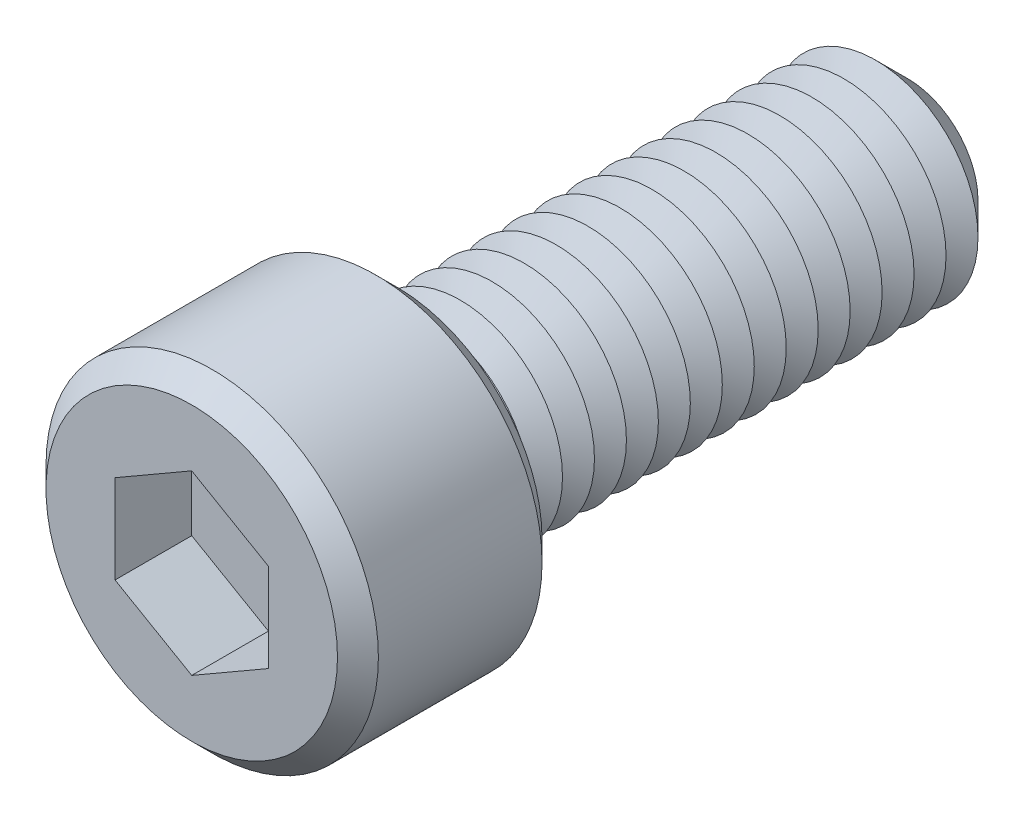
ISO-10303-21;
HEADER;
FILE_DESCRIPTION(('STEP AP214'),'2;1');
FILE_NAME('part.step','',(''),(''),'','','');
FILE_SCHEMA(('AUTOMOTIVE_DESIGN { 1 0 10303 214 1 1 1 1 }'));
ENDSEC;
DATA;
#1=APPLICATION_CONTEXT('core data for automotive mechanical design processes');
#2=APPLICATION_PROTOCOL_DEFINITION('international standard','automotive_design',2000,#1);
#3=PRODUCT_CONTEXT('',#1,'mechanical');
#4=PRODUCT('Part','Part','',(#3));
#5=PRODUCT_RELATED_PRODUCT_CATEGORY('part','',(#4));
#6=PRODUCT_DEFINITION_FORMATION('','',#4);
#7=PRODUCT_DEFINITION_CONTEXT('part definition',#1,'design');
#8=PRODUCT_DEFINITION('design','',#6,#7);
#9=PRODUCT_DEFINITION_SHAPE('','',#8);
#10=(LENGTH_UNIT() NAMED_UNIT(*) SI_UNIT(.MILLI.,.METRE.));
#11=(NAMED_UNIT(*) PLANE_ANGLE_UNIT() SI_UNIT($,.RADIAN.));
#12=(NAMED_UNIT(*) SI_UNIT($,.STERADIAN.) SOLID_ANGLE_UNIT());
#13=UNCERTAINTY_MEASURE_WITH_UNIT(LENGTH_MEASURE(1.E-05),#10,'distance_accuracy_value','');
#14=(GEOMETRIC_REPRESENTATION_CONTEXT(3) GLOBAL_UNCERTAINTY_ASSIGNED_CONTEXT((#13)) GLOBAL_UNIT_ASSIGNED_CONTEXT((#10,
#11,#12)) REPRESENTATION_CONTEXT('',''));
#15=CARTESIAN_POINT('',(0.,0.,0.));
#16=DIRECTION('',(0.,0.,1.));
#17=DIRECTION('',(1.,0.,0.));
#18=AXIS2_PLACEMENT_3D('',#15,#16,#17);
#19=CARTESIAN_POINT('',(0.,0.,8.));
#20=DIRECTION('',(0.,0.,-1.));
#21=DIRECTION('',(-1.,0.,0.));
#22=AXIS2_PLACEMENT_3D('',#19,#20,#21);
#23=CYLINDRICAL_SURFACE('',#22,6.5);
#24=CARTESIAN_POINT('',(0.,0.,0.800000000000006));
#25=DIRECTION('',(0.,0.,1.));
#26=DIRECTION('',(1.,0.,0.));
#27=AXIS2_PLACEMENT_3D('',#24,#25,#26);
#28=CIRCLE('',#27,6.5);
#29=CARTESIAN_POINT('',(6.5,0.,0.800000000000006));
#30=VERTEX_POINT('',#29);
#31=EDGE_CURVE('E297',#30,#30,#28,.T.);
#32=ORIENTED_EDGE('',*,*,#31,.T.);
#33=EDGE_LOOP('',(#32));
#34=FACE_BOUND('',#33,.T.);
#35=CARTESIAN_POINT('',(0.,0.,7.19999999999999));
#36=DIRECTION('',(0.,0.,1.));
#37=DIRECTION('',(1.,0.,0.));
#38=AXIS2_PLACEMENT_3D('',#35,#36,#37);
#39=CIRCLE('',#38,6.5);
#40=CARTESIAN_POINT('',(6.5,0.,7.19999999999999));
#41=VERTEX_POINT('',#40);
#42=EDGE_CURVE('E294',#41,#41,#39,.F.);
#43=ORIENTED_EDGE('',*,*,#42,.T.);
#44=EDGE_LOOP('',(#43));
#45=FACE_BOUND('',#44,.T.);
#46=ADVANCED_FACE('F39',(#34,#45),#23,.T.);
#47=CARTESIAN_POINT('',(0.,0.,8.));
#48=DIRECTION('',(0.,0.,1.));
#49=DIRECTION('',(1.,0.,0.));
#50=AXIS2_PLACEMENT_3D('',#47,#48,#49);
#51=PLANE('',#50);
#52=CARTESIAN_POINT('',(0.,0.,8.));
#53=DIRECTION('',(0.,0.,1.));
#54=DIRECTION('',(1.,0.,0.));
#55=AXIS2_PLACEMENT_3D('',#52,#53,#54);
#56=CIRCLE('',#55,5.7);
#57=CARTESIAN_POINT('',(5.7,0.,8.));
#58=VERTEX_POINT('',#57);
#59=EDGE_CURVE('E11',#58,#58,#56,.T.);
#60=ORIENTED_EDGE('',*,*,#59,.T.);
#61=EDGE_LOOP('',(#60));
#62=FACE_BOUND('',#61,.T.);
#63=DIRECTION('',(-0.866025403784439,0.5,0.));
#64=VECTOR('',#63,1.);
#65=CARTESIAN_POINT('',(3.,1.73205080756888,8.));
#66=LINE('',#65,#64);
#67=CARTESIAN_POINT('',(3.,1.73205080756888,8.));
#68=VERTEX_POINT('',#67);
#69=CARTESIAN_POINT('',(0.,3.46410161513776,8.));
#70=VERTEX_POINT('',#69);
#71=EDGE_CURVE('E55',#68,#70,#66,.T.);
#72=ORIENTED_EDGE('',*,*,#71,.F.);
#73=DIRECTION('',(0.,1.,0.));
#74=VECTOR('',#73,1.);
#75=CARTESIAN_POINT('',(3.,-1.73205080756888,8.));
#76=LINE('',#75,#74);
#77=CARTESIAN_POINT('',(3.,-1.73205080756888,8.));
#78=VERTEX_POINT('',#77);
#79=EDGE_CURVE('E151',#78,#68,#76,.T.);
#80=ORIENTED_EDGE('',*,*,#79,.F.);
#81=DIRECTION('',(0.866025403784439,0.5,0.));
#82=VECTOR('',#81,1.);
#83=CARTESIAN_POINT('',(0.,-3.46410161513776,8.));
#84=LINE('',#83,#82);
#85=CARTESIAN_POINT('',(0.,-3.46410161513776,8.));
#86=VERTEX_POINT('',#85);
#87=EDGE_CURVE('E148',#86,#78,#84,.T.);
#88=ORIENTED_EDGE('',*,*,#87,.F.);
#89=DIRECTION('',(0.866025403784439,-0.5,0.));
#90=VECTOR('',#89,1.);
#91=CARTESIAN_POINT('',(-3.,-1.73205080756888,8.));
#92=LINE('',#91,#90);
#93=CARTESIAN_POINT('',(-3.,-1.73205080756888,8.));
#94=VERTEX_POINT('',#93);
#95=EDGE_CURVE('E103',#94,#86,#92,.T.);
#96=ORIENTED_EDGE('',*,*,#95,.F.);
#97=DIRECTION('',(0.,-1.,0.));
#98=VECTOR('',#97,1.);
#99=CARTESIAN_POINT('',(-3.,1.73205080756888,8.));
#100=LINE('',#99,#98);
#101=CARTESIAN_POINT('',(-3.,1.73205080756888,8.));
#102=VERTEX_POINT('',#101);
#103=EDGE_CURVE('E142',#102,#94,#100,.T.);
#104=ORIENTED_EDGE('',*,*,#103,.F.);
#105=DIRECTION('',(-0.866025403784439,-0.5,0.));
#106=VECTOR('',#105,1.);
#107=CARTESIAN_POINT('',(0.,3.46410161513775,8.));
#108=LINE('',#107,#106);
#109=EDGE_CURVE('E137',#70,#102,#108,.T.);
#110=ORIENTED_EDGE('',*,*,#109,.F.);
#111=EDGE_LOOP('',(#72,#80,#88,#96,#104,#110));
#112=FACE_BOUND('',#111,.T.);
#113=ADVANCED_FACE('F315',(#62,#112),#51,.T.);
#114=CARTESIAN_POINT('',(0.,0.,0.));
#115=DIRECTION('',(0.,0.,1.));
#116=DIRECTION('',(1.,0.,0.));
#117=AXIS2_PLACEMENT_3D('',#114,#115,#116);
#118=PLANE('',#117);
#119=CARTESIAN_POINT('',(0.,0.,0.));
#120=DIRECTION('',(0.,0.,1.));
#121=DIRECTION('',(1.,0.,0.));
#122=AXIS2_PLACEMENT_3D('',#119,#120,#121);
#123=CIRCLE('',#122,5.69999999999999);
#124=CARTESIAN_POINT('',(5.69999999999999,0.,0.));
#125=VERTEX_POINT('',#124);
#126=EDGE_CURVE('E48',#125,#125,#123,.F.);
#127=ORIENTED_EDGE('',*,*,#126,.T.);
#128=EDGE_LOOP('',(#127));
#129=FACE_BOUND('',#128,.T.);
#130=CARTESIAN_POINT('',(0.,0.,0.));
#131=DIRECTION('',(0.,0.,1.));
#132=DIRECTION('',(1.,0.,0.));
#133=AXIS2_PLACEMENT_3D('',#130,#131,#132);
#134=CIRCLE('',#133,4.);
#135=CARTESIAN_POINT('',(4.,0.,0.));
#136=VERTEX_POINT('',#135);
#137=EDGE_CURVE('E286',#136,#136,#134,.T.);
#138=ORIENTED_EDGE('',*,*,#137,.T.);
#139=EDGE_LOOP('',(#138));
#140=FACE_BOUND('',#139,.T.);
#141=ADVANCED_FACE('F304',(#129,#140),#118,.F.);
#142=CARTESIAN_POINT('',(0.,0.,0.));
#143=DIRECTION('',(0.,0.,1.));
#144=DIRECTION('',(1.,0.,0.));
#145=AXIS2_PLACEMENT_3D('',#142,#143,#144);
#146=CONICAL_SURFACE('',#145,4.,1.0471975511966);
#147=CARTESIAN_POINT('',(0.,0.,-0.625));
#148=DIRECTION('',(0.,0.,1.));
#149=DIRECTION('',(1.,0.,0.));
#150=AXIS2_PLACEMENT_3D('',#147,#148,#149);
#151=CIRCLE('',#150,2.91746824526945);
#152=CARTESIAN_POINT('',(2.91746824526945,0.,-0.625));
#153=VERTEX_POINT('',#152);
#154=EDGE_CURVE('E282',#153,#153,#151,.T.);
#155=ORIENTED_EDGE('',*,*,#154,.T.);
#156=EDGE_LOOP('',(#155));
#157=FACE_BOUND('',#156,.T.);
#158=ORIENTED_EDGE('',*,*,#137,.F.);
#159=EDGE_LOOP('',(#158));
#160=FACE_BOUND('',#159,.T.);
#161=ADVANCED_FACE('F484',(#157,#160),#146,.T.);
#162=CARTESIAN_POINT('',(0.,0.,-0.625));
#163=DIRECTION('',(0.,0.,-1.));
#164=DIRECTION('',(-1.,0.,0.));
#165=AXIS2_PLACEMENT_3D('',#162,#163,#164);
#166=CONICAL_SURFACE('',#165,2.91746824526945,1.0471975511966);
#167=CARTESIAN_POINT('',(0.,0.,-1.25));
#168=DIRECTION('',(0.,0.,1.));
#169=DIRECTION('',(1.,0.,0.));
#170=AXIS2_PLACEMENT_3D('',#167,#168,#169);
#171=CIRCLE('',#170,4.);
#172=CARTESIAN_POINT('',(4.,0.,-1.25));
#173=VERTEX_POINT('',#172);
#174=EDGE_CURVE('E278',#173,#173,#171,.T.);
#175=ORIENTED_EDGE('',*,*,#174,.T.);
#176=EDGE_LOOP('',(#175));
#177=FACE_BOUND('',#176,.T.);
#178=ORIENTED_EDGE('',*,*,#154,.F.);
#179=EDGE_LOOP('',(#178));
#180=FACE_BOUND('',#179,.T.);
#181=ADVANCED_FACE('F480',(#177,#180),#166,.T.);
#182=CARTESIAN_POINT('',(0.,0.,-1.25));
#183=DIRECTION('',(0.,0.,1.));
#184=DIRECTION('',(1.,0.,0.));
#185=AXIS2_PLACEMENT_3D('',#182,#183,#184);
#186=CONICAL_SURFACE('',#185,4.,1.0471975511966);
#187=CARTESIAN_POINT('',(0.,0.,-1.875));
#188=DIRECTION('',(0.,0.,1.));
#189=DIRECTION('',(1.,0.,0.));
#190=AXIS2_PLACEMENT_3D('',#187,#188,#189);
#191=CIRCLE('',#190,2.91746824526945);
#192=CARTESIAN_POINT('',(2.91746824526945,0.,-1.875));
#193=VERTEX_POINT('',#192);
#194=EDGE_CURVE('E274',#193,#193,#191,.T.);
#195=ORIENTED_EDGE('',*,*,#194,.T.);
#196=EDGE_LOOP('',(#195));
#197=FACE_BOUND('',#196,.T.);
#198=ORIENTED_EDGE('',*,*,#174,.F.);
#199=EDGE_LOOP('',(#198));
#200=FACE_BOUND('',#199,.T.);
#201=ADVANCED_FACE('F476',(#197,#200),#186,.T.);
#202=CARTESIAN_POINT('',(0.,0.,-1.875));
#203=DIRECTION('',(0.,0.,-1.));
#204=DIRECTION('',(-1.,0.,0.));
#205=AXIS2_PLACEMENT_3D('',#202,#203,#204);
#206=CONICAL_SURFACE('',#205,2.91746824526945,1.0471975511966);
#207=CARTESIAN_POINT('',(0.,0.,-2.5));
#208=DIRECTION('',(0.,0.,1.));
#209=DIRECTION('',(1.,0.,0.));
#210=AXIS2_PLACEMENT_3D('',#207,#208,#209);
#211=CIRCLE('',#210,4.);
#212=CARTESIAN_POINT('',(4.,0.,-2.5));
#213=VERTEX_POINT('',#212);
#214=EDGE_CURVE('E270',#213,#213,#211,.T.);
#215=ORIENTED_EDGE('',*,*,#214,.T.);
#216=EDGE_LOOP('',(#215));
#217=FACE_BOUND('',#216,.T.);
#218=ORIENTED_EDGE('',*,*,#194,.F.);
#219=EDGE_LOOP('',(#218));
#220=FACE_BOUND('',#219,.T.);
#221=ADVANCED_FACE('F472',(#217,#220),#206,.T.);
#222=CARTESIAN_POINT('',(0.,0.,-2.5));
#223=DIRECTION('',(0.,0.,1.));
#224=DIRECTION('',(1.,0.,0.));
#225=AXIS2_PLACEMENT_3D('',#222,#223,#224);
#226=CONICAL_SURFACE('',#225,4.,1.0471975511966);
#227=CARTESIAN_POINT('',(0.,0.,-3.125));
#228=DIRECTION('',(0.,0.,1.));
#229=DIRECTION('',(1.,0.,0.));
#230=AXIS2_PLACEMENT_3D('',#227,#228,#229);
#231=CIRCLE('',#230,2.91746824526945);
#232=CARTESIAN_POINT('',(2.91746824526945,0.,-3.125));
#233=VERTEX_POINT('',#232);
#234=EDGE_CURVE('E266',#233,#233,#231,.T.);
#235=ORIENTED_EDGE('',*,*,#234,.T.);
#236=EDGE_LOOP('',(#235));
#237=FACE_BOUND('',#236,.T.);
#238=ORIENTED_EDGE('',*,*,#214,.F.);
#239=EDGE_LOOP('',(#238));
#240=FACE_BOUND('',#239,.T.);
#241=ADVANCED_FACE('F468',(#237,#240),#226,.T.);
#242=CARTESIAN_POINT('',(0.,0.,-3.125));
#243=DIRECTION('',(0.,0.,-1.));
#244=DIRECTION('',(-1.,0.,0.));
#245=AXIS2_PLACEMENT_3D('',#242,#243,#244);
#246=CONICAL_SURFACE('',#245,2.91746824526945,1.0471975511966);
#247=CARTESIAN_POINT('',(0.,0.,-3.75));
#248=DIRECTION('',(0.,0.,1.));
#249=DIRECTION('',(1.,0.,0.));
#250=AXIS2_PLACEMENT_3D('',#247,#248,#249);
#251=CIRCLE('',#250,4.);
#252=CARTESIAN_POINT('',(4.,0.,-3.75));
#253=VERTEX_POINT('',#252);
#254=EDGE_CURVE('E262',#253,#253,#251,.T.);
#255=ORIENTED_EDGE('',*,*,#254,.T.);
#256=EDGE_LOOP('',(#255));
#257=FACE_BOUND('',#256,.T.);
#258=ORIENTED_EDGE('',*,*,#234,.F.);
#259=EDGE_LOOP('',(#258));
#260=FACE_BOUND('',#259,.T.);
#261=ADVANCED_FACE('F464',(#257,#260),#246,.T.);
#262=CARTESIAN_POINT('',(0.,0.,-3.75));
#263=DIRECTION('',(0.,0.,1.));
#264=DIRECTION('',(1.,0.,0.));
#265=AXIS2_PLACEMENT_3D('',#262,#263,#264);
#266=CONICAL_SURFACE('',#265,4.,1.0471975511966);
#267=CARTESIAN_POINT('',(0.,0.,-4.375));
#268=DIRECTION('',(0.,0.,1.));
#269=DIRECTION('',(1.,0.,0.));
#270=AXIS2_PLACEMENT_3D('',#267,#268,#269);
#271=CIRCLE('',#270,2.91746824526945);
#272=CARTESIAN_POINT('',(2.91746824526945,0.,-4.375));
#273=VERTEX_POINT('',#272);
#274=EDGE_CURVE('E258',#273,#273,#271,.T.);
#275=ORIENTED_EDGE('',*,*,#274,.T.);
#276=EDGE_LOOP('',(#275));
#277=FACE_BOUND('',#276,.T.);
#278=ORIENTED_EDGE('',*,*,#254,.F.);
#279=EDGE_LOOP('',(#278));
#280=FACE_BOUND('',#279,.T.);
#281=ADVANCED_FACE('F460',(#277,#280),#266,.T.);
#282=CARTESIAN_POINT('',(0.,0.,-4.375));
#283=DIRECTION('',(0.,0.,-1.));
#284=DIRECTION('',(-1.,0.,0.));
#285=AXIS2_PLACEMENT_3D('',#282,#283,#284);
#286=CONICAL_SURFACE('',#285,2.91746824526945,1.0471975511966);
#287=CARTESIAN_POINT('',(0.,0.,-5.));
#288=DIRECTION('',(0.,0.,1.));
#289=DIRECTION('',(1.,0.,0.));
#290=AXIS2_PLACEMENT_3D('',#287,#288,#289);
#291=CIRCLE('',#290,4.);
#292=CARTESIAN_POINT('',(4.,0.,-5.));
#293=VERTEX_POINT('',#292);
#294=EDGE_CURVE('E254',#293,#293,#291,.T.);
#295=ORIENTED_EDGE('',*,*,#294,.T.);
#296=EDGE_LOOP('',(#295));
#297=FACE_BOUND('',#296,.T.);
#298=ORIENTED_EDGE('',*,*,#274,.F.);
#299=EDGE_LOOP('',(#298));
#300=FACE_BOUND('',#299,.T.);
#301=ADVANCED_FACE('F456',(#297,#300),#286,.T.);
#302=CARTESIAN_POINT('',(0.,0.,-5.));
#303=DIRECTION('',(0.,0.,1.));
#304=DIRECTION('',(1.,0.,0.));
#305=AXIS2_PLACEMENT_3D('',#302,#303,#304);
#306=CONICAL_SURFACE('',#305,4.,1.0471975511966);
#307=CARTESIAN_POINT('',(0.,0.,-5.625));
#308=DIRECTION('',(0.,0.,1.));
#309=DIRECTION('',(1.,0.,0.));
#310=AXIS2_PLACEMENT_3D('',#307,#308,#309);
#311=CIRCLE('',#310,2.91746824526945);
#312=CARTESIAN_POINT('',(2.91746824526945,0.,-5.625));
#313=VERTEX_POINT('',#312);
#314=EDGE_CURVE('E250',#313,#313,#311,.T.);
#315=ORIENTED_EDGE('',*,*,#314,.T.);
#316=EDGE_LOOP('',(#315));
#317=FACE_BOUND('',#316,.T.);
#318=ORIENTED_EDGE('',*,*,#294,.F.);
#319=EDGE_LOOP('',(#318));
#320=FACE_BOUND('',#319,.T.);
#321=ADVANCED_FACE('F452',(#317,#320),#306,.T.);
#322=CARTESIAN_POINT('',(0.,0.,-5.625));
#323=DIRECTION('',(0.,0.,-1.));
#324=DIRECTION('',(-1.,0.,0.));
#325=AXIS2_PLACEMENT_3D('',#322,#323,#324);
#326=CONICAL_SURFACE('',#325,2.91746824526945,1.0471975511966);
#327=CARTESIAN_POINT('',(0.,0.,-6.25));
#328=DIRECTION('',(0.,0.,1.));
#329=DIRECTION('',(1.,0.,0.));
#330=AXIS2_PLACEMENT_3D('',#327,#328,#329);
#331=CIRCLE('',#330,4.);
#332=CARTESIAN_POINT('',(4.,0.,-6.25));
#333=VERTEX_POINT('',#332);
#334=EDGE_CURVE('E246',#333,#333,#331,.T.);
#335=ORIENTED_EDGE('',*,*,#334,.T.);
#336=EDGE_LOOP('',(#335));
#337=FACE_BOUND('',#336,.T.);
#338=ORIENTED_EDGE('',*,*,#314,.F.);
#339=EDGE_LOOP('',(#338));
#340=FACE_BOUND('',#339,.T.);
#341=ADVANCED_FACE('F448',(#337,#340),#326,.T.);
#342=CARTESIAN_POINT('',(0.,0.,-6.25));
#343=DIRECTION('',(0.,0.,1.));
#344=DIRECTION('',(1.,0.,0.));
#345=AXIS2_PLACEMENT_3D('',#342,#343,#344);
#346=CONICAL_SURFACE('',#345,4.,1.0471975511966);
#347=CARTESIAN_POINT('',(0.,0.,-6.875));
#348=DIRECTION('',(0.,0.,1.));
#349=DIRECTION('',(1.,0.,0.));
#350=AXIS2_PLACEMENT_3D('',#347,#348,#349);
#351=CIRCLE('',#350,2.91746824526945);
#352=CARTESIAN_POINT('',(2.91746824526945,0.,-6.875));
#353=VERTEX_POINT('',#352);
#354=EDGE_CURVE('E242',#353,#353,#351,.T.);
#355=ORIENTED_EDGE('',*,*,#354,.T.);
#356=EDGE_LOOP('',(#355));
#357=FACE_BOUND('',#356,.T.);
#358=ORIENTED_EDGE('',*,*,#334,.F.);
#359=EDGE_LOOP('',(#358));
#360=FACE_BOUND('',#359,.T.);
#361=ADVANCED_FACE('F444',(#357,#360),#346,.T.);
#362=CARTESIAN_POINT('',(0.,0.,-6.875));
#363=DIRECTION('',(0.,0.,-1.));
#364=DIRECTION('',(-1.,0.,0.));
#365=AXIS2_PLACEMENT_3D('',#362,#363,#364);
#366=CONICAL_SURFACE('',#365,2.91746824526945,1.0471975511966);
#367=CARTESIAN_POINT('',(0.,0.,-7.5));
#368=DIRECTION('',(0.,0.,1.));
#369=DIRECTION('',(1.,0.,0.));
#370=AXIS2_PLACEMENT_3D('',#367,#368,#369);
#371=CIRCLE('',#370,4.);
#372=CARTESIAN_POINT('',(4.,0.,-7.5));
#373=VERTEX_POINT('',#372);
#374=EDGE_CURVE('E238',#373,#373,#371,.T.);
#375=ORIENTED_EDGE('',*,*,#374,.T.);
#376=EDGE_LOOP('',(#375));
#377=FACE_BOUND('',#376,.T.);
#378=ORIENTED_EDGE('',*,*,#354,.F.);
#379=EDGE_LOOP('',(#378));
#380=FACE_BOUND('',#379,.T.);
#381=ADVANCED_FACE('F440',(#377,#380),#366,.T.);
#382=CARTESIAN_POINT('',(0.,0.,-7.5));
#383=DIRECTION('',(0.,0.,1.));
#384=DIRECTION('',(1.,0.,0.));
#385=AXIS2_PLACEMENT_3D('',#382,#383,#384);
#386=CONICAL_SURFACE('',#385,4.,1.0471975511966);
#387=CARTESIAN_POINT('',(0.,0.,-8.125));
#388=DIRECTION('',(0.,0.,1.));
#389=DIRECTION('',(1.,0.,0.));
#390=AXIS2_PLACEMENT_3D('',#387,#388,#389);
#391=CIRCLE('',#390,2.91746824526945);
#392=CARTESIAN_POINT('',(2.91746824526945,0.,-8.125));
#393=VERTEX_POINT('',#392);
#394=EDGE_CURVE('E234',#393,#393,#391,.T.);
#395=ORIENTED_EDGE('',*,*,#394,.T.);
#396=EDGE_LOOP('',(#395));
#397=FACE_BOUND('',#396,.T.);
#398=ORIENTED_EDGE('',*,*,#374,.F.);
#399=EDGE_LOOP('',(#398));
#400=FACE_BOUND('',#399,.T.);
#401=ADVANCED_FACE('F436',(#397,#400),#386,.T.);
#402=CARTESIAN_POINT('',(0.,0.,-8.125));
#403=DIRECTION('',(0.,0.,-1.));
#404=DIRECTION('',(-1.,0.,0.));
#405=AXIS2_PLACEMENT_3D('',#402,#403,#404);
#406=CONICAL_SURFACE('',#405,2.91746824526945,1.0471975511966);
#407=CARTESIAN_POINT('',(0.,0.,-8.75));
#408=DIRECTION('',(0.,0.,1.));
#409=DIRECTION('',(1.,0.,0.));
#410=AXIS2_PLACEMENT_3D('',#407,#408,#409);
#411=CIRCLE('',#410,4.);
#412=CARTESIAN_POINT('',(4.,0.,-8.75));
#413=VERTEX_POINT('',#412);
#414=EDGE_CURVE('E230',#413,#413,#411,.T.);
#415=ORIENTED_EDGE('',*,*,#414,.T.);
#416=EDGE_LOOP('',(#415));
#417=FACE_BOUND('',#416,.T.);
#418=ORIENTED_EDGE('',*,*,#394,.F.);
#419=EDGE_LOOP('',(#418));
#420=FACE_BOUND('',#419,.T.);
#421=ADVANCED_FACE('F432',(#417,#420),#406,.T.);
#422=CARTESIAN_POINT('',(0.,0.,-8.75));
#423=DIRECTION('',(0.,0.,1.));
#424=DIRECTION('',(1.,0.,0.));
#425=AXIS2_PLACEMENT_3D('',#422,#423,#424);
#426=CONICAL_SURFACE('',#425,4.,1.0471975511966);
#427=CARTESIAN_POINT('',(0.,0.,-9.375));
#428=DIRECTION('',(0.,0.,1.));
#429=DIRECTION('',(1.,0.,0.));
#430=AXIS2_PLACEMENT_3D('',#427,#428,#429);
#431=CIRCLE('',#430,2.91746824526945);
#432=CARTESIAN_POINT('',(2.91746824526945,0.,-9.375));
#433=VERTEX_POINT('',#432);
#434=EDGE_CURVE('E226',#433,#433,#431,.T.);
#435=ORIENTED_EDGE('',*,*,#434,.T.);
#436=EDGE_LOOP('',(#435));
#437=FACE_BOUND('',#436,.T.);
#438=ORIENTED_EDGE('',*,*,#414,.F.);
#439=EDGE_LOOP('',(#438));
#440=FACE_BOUND('',#439,.T.);
#441=ADVANCED_FACE('F428',(#437,#440),#426,.T.);
#442=CARTESIAN_POINT('',(0.,0.,-9.375));
#443=DIRECTION('',(0.,0.,-1.));
#444=DIRECTION('',(-1.,0.,0.));
#445=AXIS2_PLACEMENT_3D('',#442,#443,#444);
#446=CONICAL_SURFACE('',#445,2.91746824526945,1.0471975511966);
#447=CARTESIAN_POINT('',(0.,0.,-10.));
#448=DIRECTION('',(0.,0.,1.));
#449=DIRECTION('',(1.,0.,0.));
#450=AXIS2_PLACEMENT_3D('',#447,#448,#449);
#451=CIRCLE('',#450,4.);
#452=CARTESIAN_POINT('',(4.,0.,-10.));
#453=VERTEX_POINT('',#452);
#454=EDGE_CURVE('E222',#453,#453,#451,.T.);
#455=ORIENTED_EDGE('',*,*,#454,.T.);
#456=EDGE_LOOP('',(#455));
#457=FACE_BOUND('',#456,.T.);
#458=ORIENTED_EDGE('',*,*,#434,.F.);
#459=EDGE_LOOP('',(#458));
#460=FACE_BOUND('',#459,.T.);
#461=ADVANCED_FACE('F424',(#457,#460),#446,.T.);
#462=CARTESIAN_POINT('',(0.,0.,-10.));
#463=DIRECTION('',(0.,0.,1.));
#464=DIRECTION('',(1.,0.,0.));
#465=AXIS2_PLACEMENT_3D('',#462,#463,#464);
#466=CONICAL_SURFACE('',#465,4.,1.0471975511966);
#467=CARTESIAN_POINT('',(0.,0.,-10.625));
#468=DIRECTION('',(0.,0.,1.));
#469=DIRECTION('',(1.,0.,0.));
#470=AXIS2_PLACEMENT_3D('',#467,#468,#469);
#471=CIRCLE('',#470,2.91746824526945);
#472=CARTESIAN_POINT('',(2.91746824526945,0.,-10.625));
#473=VERTEX_POINT('',#472);
#474=EDGE_CURVE('E218',#473,#473,#471,.T.);
#475=ORIENTED_EDGE('',*,*,#474,.T.);
#476=EDGE_LOOP('',(#475));
#477=FACE_BOUND('',#476,.T.);
#478=ORIENTED_EDGE('',*,*,#454,.F.);
#479=EDGE_LOOP('',(#478));
#480=FACE_BOUND('',#479,.T.);
#481=ADVANCED_FACE('F420',(#477,#480),#466,.T.);
#482=CARTESIAN_POINT('',(0.,0.,-10.625));
#483=DIRECTION('',(0.,0.,-1.));
#484=DIRECTION('',(-1.,0.,0.));
#485=AXIS2_PLACEMENT_3D('',#482,#483,#484);
#486=CONICAL_SURFACE('',#485,2.91746824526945,1.0471975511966);
#487=CARTESIAN_POINT('',(0.,0.,-11.25));
#488=DIRECTION('',(0.,0.,1.));
#489=DIRECTION('',(1.,0.,0.));
#490=AXIS2_PLACEMENT_3D('',#487,#488,#489);
#491=CIRCLE('',#490,4.);
#492=CARTESIAN_POINT('',(4.,0.,-11.25));
#493=VERTEX_POINT('',#492);
#494=EDGE_CURVE('E214',#493,#493,#491,.T.);
#495=ORIENTED_EDGE('',*,*,#494,.T.);
#496=EDGE_LOOP('',(#495));
#497=FACE_BOUND('',#496,.T.);
#498=ORIENTED_EDGE('',*,*,#474,.F.);
#499=EDGE_LOOP('',(#498));
#500=FACE_BOUND('',#499,.T.);
#501=ADVANCED_FACE('F416',(#497,#500),#486,.T.);
#502=CARTESIAN_POINT('',(0.,0.,-11.25));
#503=DIRECTION('',(0.,0.,1.));
#504=DIRECTION('',(1.,0.,0.));
#505=AXIS2_PLACEMENT_3D('',#502,#503,#504);
#506=CONICAL_SURFACE('',#505,4.,1.0471975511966);
#507=CARTESIAN_POINT('',(0.,0.,-11.875));
#508=DIRECTION('',(0.,0.,1.));
#509=DIRECTION('',(1.,0.,0.));
#510=AXIS2_PLACEMENT_3D('',#507,#508,#509);
#511=CIRCLE('',#510,2.91746824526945);
#512=CARTESIAN_POINT('',(2.91746824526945,0.,-11.875));
#513=VERTEX_POINT('',#512);
#514=EDGE_CURVE('E210',#513,#513,#511,.T.);
#515=ORIENTED_EDGE('',*,*,#514,.T.);
#516=EDGE_LOOP('',(#515));
#517=FACE_BOUND('',#516,.T.);
#518=ORIENTED_EDGE('',*,*,#494,.F.);
#519=EDGE_LOOP('',(#518));
#520=FACE_BOUND('',#519,.T.);
#521=ADVANCED_FACE('F412',(#517,#520),#506,.T.);
#522=CARTESIAN_POINT('',(0.,0.,-11.875));
#523=DIRECTION('',(0.,0.,-1.));
#524=DIRECTION('',(-1.,0.,0.));
#525=AXIS2_PLACEMENT_3D('',#522,#523,#524);
#526=CONICAL_SURFACE('',#525,2.91746824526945,1.0471975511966);
#527=CARTESIAN_POINT('',(0.,0.,-12.5));
#528=DIRECTION('',(0.,0.,1.));
#529=DIRECTION('',(1.,0.,0.));
#530=AXIS2_PLACEMENT_3D('',#527,#528,#529);
#531=CIRCLE('',#530,4.);
#532=CARTESIAN_POINT('',(4.,0.,-12.5));
#533=VERTEX_POINT('',#532);
#534=EDGE_CURVE('E206',#533,#533,#531,.T.);
#535=ORIENTED_EDGE('',*,*,#534,.T.);
#536=EDGE_LOOP('',(#535));
#537=FACE_BOUND('',#536,.T.);
#538=ORIENTED_EDGE('',*,*,#514,.F.);
#539=EDGE_LOOP('',(#538));
#540=FACE_BOUND('',#539,.T.);
#541=ADVANCED_FACE('F408',(#537,#540),#526,.T.);
#542=CARTESIAN_POINT('',(0.,0.,-12.5));
#543=DIRECTION('',(0.,0.,1.));
#544=DIRECTION('',(1.,0.,0.));
#545=AXIS2_PLACEMENT_3D('',#542,#543,#544);
#546=CONICAL_SURFACE('',#545,4.,1.0471975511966);
#547=CARTESIAN_POINT('',(0.,0.,-13.125));
#548=DIRECTION('',(0.,0.,1.));
#549=DIRECTION('',(1.,0.,0.));
#550=AXIS2_PLACEMENT_3D('',#547,#548,#549);
#551=CIRCLE('',#550,2.91746824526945);
#552=CARTESIAN_POINT('',(2.91746824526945,0.,-13.125));
#553=VERTEX_POINT('',#552);
#554=EDGE_CURVE('E202',#553,#553,#551,.T.);
#555=ORIENTED_EDGE('',*,*,#554,.T.);
#556=EDGE_LOOP('',(#555));
#557=FACE_BOUND('',#556,.T.);
#558=ORIENTED_EDGE('',*,*,#534,.F.);
#559=EDGE_LOOP('',(#558));
#560=FACE_BOUND('',#559,.T.);
#561=ADVANCED_FACE('F404',(#557,#560),#546,.T.);
#562=CARTESIAN_POINT('',(0.,0.,-13.125));
#563=DIRECTION('',(0.,0.,-1.));
#564=DIRECTION('',(-1.,0.,0.));
#565=AXIS2_PLACEMENT_3D('',#562,#563,#564);
#566=CONICAL_SURFACE('',#565,2.91746824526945,1.0471975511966);
#567=CARTESIAN_POINT('',(0.,0.,-13.75));
#568=DIRECTION('',(0.,0.,1.));
#569=DIRECTION('',(1.,0.,0.));
#570=AXIS2_PLACEMENT_3D('',#567,#568,#569);
#571=CIRCLE('',#570,4.);
#572=CARTESIAN_POINT('',(4.,0.,-13.75));
#573=VERTEX_POINT('',#572);
#574=EDGE_CURVE('E198',#573,#573,#571,.T.);
#575=ORIENTED_EDGE('',*,*,#574,.T.);
#576=EDGE_LOOP('',(#575));
#577=FACE_BOUND('',#576,.T.);
#578=ORIENTED_EDGE('',*,*,#554,.F.);
#579=EDGE_LOOP('',(#578));
#580=FACE_BOUND('',#579,.T.);
#581=ADVANCED_FACE('F400',(#577,#580),#566,.T.);
#582=CARTESIAN_POINT('',(0.,0.,-13.75));
#583=DIRECTION('',(0.,0.,1.));
#584=DIRECTION('',(1.,0.,0.));
#585=AXIS2_PLACEMENT_3D('',#582,#583,#584);
#586=CONICAL_SURFACE('',#585,4.,1.0471975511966);
#587=CARTESIAN_POINT('',(0.,0.,-14.375));
#588=DIRECTION('',(0.,0.,1.));
#589=DIRECTION('',(1.,0.,0.));
#590=AXIS2_PLACEMENT_3D('',#587,#588,#589);
#591=CIRCLE('',#590,2.91746824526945);
#592=CARTESIAN_POINT('',(2.91746824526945,0.,-14.375));
#593=VERTEX_POINT('',#592);
#594=EDGE_CURVE('E194',#593,#593,#591,.T.);
#595=ORIENTED_EDGE('',*,*,#594,.T.);
#596=EDGE_LOOP('',(#595));
#597=FACE_BOUND('',#596,.T.);
#598=ORIENTED_EDGE('',*,*,#574,.F.);
#599=EDGE_LOOP('',(#598));
#600=FACE_BOUND('',#599,.T.);
#601=ADVANCED_FACE('F396',(#597,#600),#586,.T.);
#602=CARTESIAN_POINT('',(0.,0.,-14.375));
#603=DIRECTION('',(0.,0.,-1.));
#604=DIRECTION('',(-1.,0.,0.));
#605=AXIS2_PLACEMENT_3D('',#602,#603,#604);
#606=CONICAL_SURFACE('',#605,2.91746824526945,1.0471975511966);
#607=CARTESIAN_POINT('',(0.,0.,-15.));
#608=DIRECTION('',(0.,0.,1.));
#609=DIRECTION('',(1.,0.,0.));
#610=AXIS2_PLACEMENT_3D('',#607,#608,#609);
#611=CIRCLE('',#610,4.);
#612=CARTESIAN_POINT('',(4.,0.,-15.));
#613=VERTEX_POINT('',#612);
#614=EDGE_CURVE('E190',#613,#613,#611,.T.);
#615=ORIENTED_EDGE('',*,*,#614,.T.);
#616=EDGE_LOOP('',(#615));
#617=FACE_BOUND('',#616,.T.);
#618=ORIENTED_EDGE('',*,*,#594,.F.);
#619=EDGE_LOOP('',(#618));
#620=FACE_BOUND('',#619,.T.);
#621=ADVANCED_FACE('F392',(#617,#620),#606,.T.);
#622=CARTESIAN_POINT('',(0.,0.,-15.));
#623=DIRECTION('',(0.,0.,1.));
#624=DIRECTION('',(1.,0.,0.));
#625=AXIS2_PLACEMENT_3D('',#622,#623,#624);
#626=CONICAL_SURFACE('',#625,4.,1.0471975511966);
#627=CARTESIAN_POINT('',(0.,0.,-15.625));
#628=DIRECTION('',(0.,0.,1.));
#629=DIRECTION('',(1.,0.,0.));
#630=AXIS2_PLACEMENT_3D('',#627,#628,#629);
#631=CIRCLE('',#630,2.91746824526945);
#632=CARTESIAN_POINT('',(2.91746824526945,0.,-15.625));
#633=VERTEX_POINT('',#632);
#634=EDGE_CURVE('E186',#633,#633,#631,.T.);
#635=ORIENTED_EDGE('',*,*,#634,.T.);
#636=EDGE_LOOP('',(#635));
#637=FACE_BOUND('',#636,.T.);
#638=ORIENTED_EDGE('',*,*,#614,.F.);
#639=EDGE_LOOP('',(#638));
#640=FACE_BOUND('',#639,.T.);
#641=ADVANCED_FACE('F388',(#637,#640),#626,.T.);
#642=CARTESIAN_POINT('',(0.,0.,-15.625));
#643=DIRECTION('',(0.,0.,-1.));
#644=DIRECTION('',(-1.,0.,0.));
#645=AXIS2_PLACEMENT_3D('',#642,#643,#644);
#646=CONICAL_SURFACE('',#645,2.91746824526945,1.0471975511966);
#647=CARTESIAN_POINT('',(0.,0.,-16.25));
#648=DIRECTION('',(0.,0.,1.));
#649=DIRECTION('',(1.,0.,0.));
#650=AXIS2_PLACEMENT_3D('',#647,#648,#649);
#651=CIRCLE('',#650,4.);
#652=CARTESIAN_POINT('',(4.,0.,-16.25));
#653=VERTEX_POINT('',#652);
#654=EDGE_CURVE('E182',#653,#653,#651,.T.);
#655=ORIENTED_EDGE('',*,*,#654,.T.);
#656=EDGE_LOOP('',(#655));
#657=FACE_BOUND('',#656,.T.);
#658=ORIENTED_EDGE('',*,*,#634,.F.);
#659=EDGE_LOOP('',(#658));
#660=FACE_BOUND('',#659,.T.);
#661=ADVANCED_FACE('F384',(#657,#660),#646,.T.);
#662=CARTESIAN_POINT('',(0.,0.,-16.25));
#663=DIRECTION('',(0.,0.,1.));
#664=DIRECTION('',(1.,0.,0.));
#665=AXIS2_PLACEMENT_3D('',#662,#663,#664);
#666=CONICAL_SURFACE('',#665,4.,1.0471975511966);
#667=CARTESIAN_POINT('',(0.,0.,-16.875));
#668=DIRECTION('',(0.,0.,1.));
#669=DIRECTION('',(1.,0.,0.));
#670=AXIS2_PLACEMENT_3D('',#667,#668,#669);
#671=CIRCLE('',#670,2.91746824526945);
#672=CARTESIAN_POINT('',(2.91746824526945,0.,-16.875));
#673=VERTEX_POINT('',#672);
#674=EDGE_CURVE('E178',#673,#673,#671,.T.);
#675=ORIENTED_EDGE('',*,*,#674,.T.);
#676=EDGE_LOOP('',(#675));
#677=FACE_BOUND('',#676,.T.);
#678=ORIENTED_EDGE('',*,*,#654,.F.);
#679=EDGE_LOOP('',(#678));
#680=FACE_BOUND('',#679,.T.);
#681=ADVANCED_FACE('F380',(#677,#680),#666,.T.);
#682=CARTESIAN_POINT('',(0.,0.,-16.875));
#683=DIRECTION('',(0.,0.,-1.));
#684=DIRECTION('',(-1.,0.,0.));
#685=AXIS2_PLACEMENT_3D('',#682,#683,#684);
#686=CONICAL_SURFACE('',#685,2.91746824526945,1.0471975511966);
#687=CARTESIAN_POINT('',(0.,0.,-17.5));
#688=DIRECTION('',(0.,0.,1.));
#689=DIRECTION('',(1.,0.,0.));
#690=AXIS2_PLACEMENT_3D('',#687,#688,#689);
#691=CIRCLE('',#690,4.);
#692=CARTESIAN_POINT('',(4.,0.,-17.5));
#693=VERTEX_POINT('',#692);
#694=EDGE_CURVE('E174',#693,#693,#691,.T.);
#695=ORIENTED_EDGE('',*,*,#694,.T.);
#696=EDGE_LOOP('',(#695));
#697=FACE_BOUND('',#696,.T.);
#698=ORIENTED_EDGE('',*,*,#674,.F.);
#699=EDGE_LOOP('',(#698));
#700=FACE_BOUND('',#699,.T.);
#701=ADVANCED_FACE('F376',(#697,#700),#686,.T.);
#702=CARTESIAN_POINT('',(0.,0.,-17.5));
#703=DIRECTION('',(0.,0.,1.));
#704=DIRECTION('',(1.,0.,0.));
#705=AXIS2_PLACEMENT_3D('',#702,#703,#704);
#706=CONICAL_SURFACE('',#705,4.,1.0471975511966);
#707=CARTESIAN_POINT('',(0.,0.,-18.125));
#708=DIRECTION('',(0.,0.,1.));
#709=DIRECTION('',(1.,0.,0.));
#710=AXIS2_PLACEMENT_3D('',#707,#708,#709);
#711=CIRCLE('',#710,2.91746824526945);
#712=CARTESIAN_POINT('',(2.91746824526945,0.,-18.125));
#713=VERTEX_POINT('',#712);
#714=EDGE_CURVE('E170',#713,#713,#711,.T.);
#715=ORIENTED_EDGE('',*,*,#714,.T.);
#716=EDGE_LOOP('',(#715));
#717=FACE_BOUND('',#716,.T.);
#718=ORIENTED_EDGE('',*,*,#694,.F.);
#719=EDGE_LOOP('',(#718));
#720=FACE_BOUND('',#719,.T.);
#721=ADVANCED_FACE('F372',(#717,#720),#706,.T.);
#722=CARTESIAN_POINT('',(0.,0.,-18.125));
#723=DIRECTION('',(0.,0.,-1.));
#724=DIRECTION('',(-1.,0.,0.));
#725=AXIS2_PLACEMENT_3D('',#722,#723,#724);
#726=CONICAL_SURFACE('',#725,2.91746824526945,1.0471975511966);
#727=CARTESIAN_POINT('',(0.,0.,-18.75));
#728=DIRECTION('',(0.,0.,1.));
#729=DIRECTION('',(1.,0.,0.));
#730=AXIS2_PLACEMENT_3D('',#727,#728,#729);
#731=CIRCLE('',#730,4.);
#732=CARTESIAN_POINT('',(4.,0.,-18.75));
#733=VERTEX_POINT('',#732);
#734=EDGE_CURVE('E157',#733,#733,#731,.T.);
#735=ORIENTED_EDGE('',*,*,#734,.T.);
#736=EDGE_LOOP('',(#735));
#737=FACE_BOUND('',#736,.T.);
#738=ORIENTED_EDGE('',*,*,#714,.F.);
#739=EDGE_LOOP('',(#738));
#740=FACE_BOUND('',#739,.T.);
#741=ADVANCED_FACE('F368',(#737,#740),#726,.T.);
#742=CARTESIAN_POINT('',(0.,0.,-20.));
#743=DIRECTION('',(0.,0.,-1.));
#744=DIRECTION('',(-1.,0.,0.));
#745=AXIS2_PLACEMENT_3D('',#742,#743,#744);
#746=PLANE('',#745);
#747=CARTESIAN_POINT('',(0.,0.,-20.));
#748=DIRECTION('',(0.,0.,-1.));
#749=DIRECTION('',(-1.,0.,0.));
#750=AXIS2_PLACEMENT_3D('',#747,#748,#749);
#751=CIRCLE('',#750,0.9);
#752=CARTESIAN_POINT('',(-0.9,0.,-20.));
#753=VERTEX_POINT('',#752);
#754=EDGE_CURVE('E138',#753,#753,#751,.F.);
#755=ORIENTED_EDGE('',*,*,#754,.T.);
#756=EDGE_LOOP('',(#755));
#757=FACE_BOUND('',#756,.T.);
#758=CARTESIAN_POINT('',(0.,0.,-20.));
#759=DIRECTION('',(0.,0.,-1.));
#760=DIRECTION('',(-1.,0.,0.));
#761=AXIS2_PLACEMENT_3D('',#758,#759,#760);
#762=CIRCLE('',#761,2.75);
#763=CARTESIAN_POINT('',(-2.75,0.,-20.));
#764=VERTEX_POINT('',#763);
#765=EDGE_CURVE('E290',#764,#764,#762,.T.);
#766=ORIENTED_EDGE('',*,*,#765,.T.);
#767=EDGE_LOOP('',(#766));
#768=FACE_BOUND('',#767,.T.);
#769=ADVANCED_FACE('F371',(#757,#768),#746,.T.);
#770=CARTESIAN_POINT('',(0.,0.,-20.));
#771=DIRECTION('',(0.,0.,1.));
#772=DIRECTION('',(1.,0.,0.));
#773=AXIS2_PLACEMENT_3D('',#770,#771,#772);
#774=CONICAL_SURFACE('',#773,2.75,0.785398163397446);
#775=ORIENTED_EDGE('',*,*,#734,.F.);
#776=EDGE_LOOP('',(#775));
#777=FACE_BOUND('',#776,.T.);
#778=ORIENTED_EDGE('',*,*,#765,.F.);
#779=EDGE_LOOP('',(#778));
#780=FACE_BOUND('',#779,.T.);
#781=ADVANCED_FACE('F367',(#777,#780),#774,.T.);
#782=CARTESIAN_POINT('',(3.,1.73205080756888,5.));
#783=DIRECTION('',(0.5,0.866025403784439,0.));
#784=DIRECTION('',(-0.866025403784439,0.5,0.));
#785=AXIS2_PLACEMENT_3D('',#782,#783,#784);
#786=PLANE('',#785);
#787=ORIENTED_EDGE('',*,*,#71,.T.);
#788=DIRECTION('',(0.,0.,1.));
#789=VECTOR('',#788,1.);
#790=CARTESIAN_POINT('',(0.,3.46410161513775,5.));
#791=LINE('',#790,#789);
#792=CARTESIAN_POINT('',(0.,3.46410161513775,5.));
#793=VERTEX_POINT('',#792);
#794=EDGE_CURVE('E85',#793,#70,#791,.T.);
#795=ORIENTED_EDGE('',*,*,#794,.F.);
#796=DIRECTION('',(-0.866025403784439,0.5,0.));
#797=VECTOR('',#796,1.);
#798=CARTESIAN_POINT('',(3.,1.73205080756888,5.));
#799=LINE('',#798,#797);
#800=CARTESIAN_POINT('',(3.,1.73205080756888,5.));
#801=VERTEX_POINT('',#800);
#802=EDGE_CURVE('E154',#801,#793,#799,.T.);
#803=ORIENTED_EDGE('',*,*,#802,.F.);
#804=DIRECTION('',(0.,0.,1.));
#805=VECTOR('',#804,1.);
#806=CARTESIAN_POINT('',(3.,1.73205080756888,5.));
#807=LINE('',#806,#805);
#808=EDGE_CURVE('E63',#801,#68,#807,.T.);
#809=ORIENTED_EDGE('',*,*,#808,.T.);
#810=EDGE_LOOP('',(#787,#795,#803,#809));
#811=FACE_BOUND('',#810,.T.);
#812=ADVANCED_FACE('F357',(#811),#786,.F.);
#813=CARTESIAN_POINT('',(3.,-1.73205080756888,5.));
#814=DIRECTION('',(1.,0.,0.));
#815=DIRECTION('',(0.,1.,0.));
#816=AXIS2_PLACEMENT_3D('',#813,#814,#815);
#817=PLANE('',#816);
#818=ORIENTED_EDGE('',*,*,#79,.T.);
#819=ORIENTED_EDGE('',*,*,#808,.F.);
#820=DIRECTION('',(0.,1.,0.));
#821=VECTOR('',#820,1.);
#822=CARTESIAN_POINT('',(3.,-1.73205080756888,5.));
#823=LINE('',#822,#821);
#824=CARTESIAN_POINT('',(3.,-1.73205080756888,5.));
#825=VERTEX_POINT('',#824);
#826=EDGE_CURVE('E117',#825,#801,#823,.T.);
#827=ORIENTED_EDGE('',*,*,#826,.F.);
#828=DIRECTION('',(0.,0.,1.));
#829=VECTOR('',#828,1.);
#830=CARTESIAN_POINT('',(3.,-1.73205080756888,5.));
#831=LINE('',#830,#829);
#832=EDGE_CURVE('E108',#825,#78,#831,.T.);
#833=ORIENTED_EDGE('',*,*,#832,.T.);
#834=EDGE_LOOP('',(#818,#819,#827,#833));
#835=FACE_BOUND('',#834,.T.);
#836=ADVANCED_FACE('F354',(#835),#817,.F.);
#837=CARTESIAN_POINT('',(0.,-3.46410161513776,5.));
#838=DIRECTION('',(0.5,-0.866025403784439,0.));
#839=DIRECTION('',(0.866025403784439,0.5,0.));
#840=AXIS2_PLACEMENT_3D('',#837,#838,#839);
#841=PLANE('',#840);
#842=ORIENTED_EDGE('',*,*,#87,.T.);
#843=ORIENTED_EDGE('',*,*,#832,.F.);
#844=DIRECTION('',(0.866025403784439,0.5,0.));
#845=VECTOR('',#844,1.);
#846=CARTESIAN_POINT('',(0.,-3.46410161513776,5.));
#847=LINE('',#846,#845);
#848=CARTESIAN_POINT('',(0.,-3.46410161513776,5.));
#849=VERTEX_POINT('',#848);
#850=EDGE_CURVE('E112',#849,#825,#847,.T.);
#851=ORIENTED_EDGE('',*,*,#850,.F.);
#852=DIRECTION('',(0.,0.,1.));
#853=VECTOR('',#852,1.);
#854=CARTESIAN_POINT('',(0.,-3.46410161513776,5.));
#855=LINE('',#854,#853);
#856=EDGE_CURVE('E96',#849,#86,#855,.T.);
#857=ORIENTED_EDGE('',*,*,#856,.T.);
#858=EDGE_LOOP('',(#842,#843,#851,#857));
#859=FACE_BOUND('',#858,.T.);
#860=ADVANCED_FACE('F113',(#859),#841,.F.);
#861=CARTESIAN_POINT('',(-3.,-1.73205080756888,5.));
#862=DIRECTION('',(-0.5,-0.866025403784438,0.));
#863=DIRECTION('',(0.866025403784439,-0.5,0.));
#864=AXIS2_PLACEMENT_3D('',#861,#862,#863);
#865=PLANE('',#864);
#866=ORIENTED_EDGE('',*,*,#95,.T.);
#867=ORIENTED_EDGE('',*,*,#856,.F.);
#868=DIRECTION('',(0.866025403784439,-0.5,0.));
#869=VECTOR('',#868,1.);
#870=CARTESIAN_POINT('',(-3.,-1.73205080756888,5.));
#871=LINE('',#870,#869);
#872=CARTESIAN_POINT('',(-3.,-1.73205080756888,5.));
#873=VERTEX_POINT('',#872);
#874=EDGE_CURVE('E100',#873,#849,#871,.T.);
#875=ORIENTED_EDGE('',*,*,#874,.F.);
#876=DIRECTION('',(0.,0.,1.));
#877=VECTOR('',#876,1.);
#878=CARTESIAN_POINT('',(-3.,-1.73205080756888,5.));
#879=LINE('',#878,#877);
#880=EDGE_CURVE('E109',#873,#94,#879,.T.);
#881=ORIENTED_EDGE('',*,*,#880,.T.);
#882=EDGE_LOOP('',(#866,#867,#875,#881));
#883=FACE_BOUND('',#882,.T.);
#884=ADVANCED_FACE('F98',(#883),#865,.F.);
#885=CARTESIAN_POINT('',(-3.,1.73205080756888,5.));
#886=DIRECTION('',(-1.,0.,0.));
#887=DIRECTION('',(0.,0.,1.));
#888=AXIS2_PLACEMENT_3D('',#885,#886,#887);
#889=PLANE('',#888);
#890=ORIENTED_EDGE('',*,*,#103,.T.);
#891=ORIENTED_EDGE('',*,*,#880,.F.);
#892=DIRECTION('',(0.,-1.,0.));
#893=VECTOR('',#892,1.);
#894=CARTESIAN_POINT('',(-3.,1.73205080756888,5.));
#895=LINE('',#894,#893);
#896=CARTESIAN_POINT('',(-3.,1.73205080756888,5.));
#897=VERTEX_POINT('',#896);
#898=EDGE_CURVE('E123',#897,#873,#895,.T.);
#899=ORIENTED_EDGE('',*,*,#898,.F.);
#900=DIRECTION('',(0.,0.,1.));
#901=VECTOR('',#900,1.);
#902=CARTESIAN_POINT('',(-3.,1.73205080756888,5.));
#903=LINE('',#902,#901);
#904=EDGE_CURVE('E162',#897,#102,#903,.T.);
#905=ORIENTED_EDGE('',*,*,#904,.T.);
#906=EDGE_LOOP('',(#890,#891,#899,#905));
#907=FACE_BOUND('',#906,.T.);
#908=ADVANCED_FACE('F351',(#907),#889,.F.);
#909=CARTESIAN_POINT('',(0.,3.46410161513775,5.));
#910=DIRECTION('',(-0.5,0.866025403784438,0.));
#911=DIRECTION('',(-0.866025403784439,-0.5,0.));
#912=AXIS2_PLACEMENT_3D('',#909,#910,#911);
#913=PLANE('',#912);
#914=ORIENTED_EDGE('',*,*,#109,.T.);
#915=ORIENTED_EDGE('',*,*,#904,.F.);
#916=DIRECTION('',(-0.866025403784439,-0.5,0.));
#917=VECTOR('',#916,1.);
#918=CARTESIAN_POINT('',(0.,3.46410161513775,5.));
#919=LINE('',#918,#917);
#920=EDGE_CURVE('E129',#793,#897,#919,.T.);
#921=ORIENTED_EDGE('',*,*,#920,.F.);
#922=ORIENTED_EDGE('',*,*,#794,.T.);
#923=EDGE_LOOP('',(#914,#915,#921,#922));
#924=FACE_BOUND('',#923,.T.);
#925=ADVANCED_FACE('F330',(#924),#913,.F.);
#926=CARTESIAN_POINT('',(0.,0.,5.));
#927=DIRECTION('',(0.,0.,1.));
#928=DIRECTION('',(1.,0.,0.));
#929=AXIS2_PLACEMENT_3D('',#926,#927,#928);
#930=PLANE('',#929);
#931=CARTESIAN_POINT('',(0.,0.,5.));
#932=DIRECTION('',(0.,0.,1.));
#933=DIRECTION('',(1.,0.,0.));
#934=AXIS2_PLACEMENT_3D('',#931,#932,#933);
#935=CIRCLE('',#934,0.9);
#936=CARTESIAN_POINT('',(0.9,0.,5.));
#937=VERTEX_POINT('',#936);
#938=EDGE_CURVE('E337',#937,#937,#935,.T.);
#939=ORIENTED_EDGE('',*,*,#938,.F.);
#940=EDGE_LOOP('',(#939));
#941=FACE_BOUND('',#940,.T.);
#942=ORIENTED_EDGE('',*,*,#802,.T.);
#943=ORIENTED_EDGE('',*,*,#920,.T.);
#944=ORIENTED_EDGE('',*,*,#898,.T.);
#945=ORIENTED_EDGE('',*,*,#874,.T.);
#946=ORIENTED_EDGE('',*,*,#850,.T.);
#947=ORIENTED_EDGE('',*,*,#826,.T.);
#948=EDGE_LOOP('',(#942,#943,#944,#945,#946,#947));
#949=FACE_BOUND('',#948,.T.);
#950=ADVANCED_FACE('F120',(#941,#949),#930,.T.);
#951=CARTESIAN_POINT('',(0.,0.,-22.5455844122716));
#952=DIRECTION('',(0.,0.,1.));
#953=DIRECTION('',(1.,0.,0.));
#954=AXIS2_PLACEMENT_3D('',#951,#952,#953);
#955=CYLINDRICAL_SURFACE('',#954,0.9);
#956=ORIENTED_EDGE('',*,*,#938,.T.);
#957=EDGE_LOOP('',(#956));
#958=FACE_BOUND('',#957,.T.);
#959=ORIENTED_EDGE('',*,*,#754,.F.);
#960=EDGE_LOOP('',(#959));
#961=FACE_BOUND('',#960,.T.);
#962=ADVANCED_FACE('F310',(#958,#961),#955,.F.);
#963=CARTESIAN_POINT('',(0.,0.,0.800000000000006));
#964=DIRECTION('',(0.,0.,1.));
#965=DIRECTION('',(1.,0.,0.));
#966=AXIS2_PLACEMENT_3D('',#963,#964,#965);
#967=CONICAL_SURFACE('',#966,6.5,0.785398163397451);
#968=ORIENTED_EDGE('',*,*,#126,.F.);
#969=EDGE_LOOP('',(#968));
#970=FACE_BOUND('',#969,.T.);
#971=ORIENTED_EDGE('',*,*,#31,.F.);
#972=EDGE_LOOP('',(#971));
#973=FACE_BOUND('',#972,.T.);
#974=ADVANCED_FACE('F307',(#970,#973),#967,.T.);
#975=CARTESIAN_POINT('',(0.,0.,8.));
#976=DIRECTION('',(0.,0.,-1.));
#977=DIRECTION('',(-1.,0.,0.));
#978=AXIS2_PLACEMENT_3D('',#975,#976,#977);
#979=CONICAL_SURFACE('',#978,5.7,0.785398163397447);
#980=ORIENTED_EDGE('',*,*,#42,.F.);
#981=EDGE_LOOP('',(#980));
#982=FACE_BOUND('',#981,.T.);
#983=ORIENTED_EDGE('',*,*,#59,.F.);
#984=EDGE_LOOP('',(#983));
#985=FACE_BOUND('',#984,.T.);
#986=ADVANCED_FACE('F41',(#982,#985),#979,.T.);
#987=CLOSED_SHELL('',(#46,#113,#141,#161,#181,#201,#221,#241,#261,#281,#301,#321,#341,#361,#381,
#401,#421,#441,#461,#481,#501,#521,#541,#561,#581,#601,#621,#641,#661,#681,#701,#721,#741,#769,
#781,#812,#836,#860,#884,#908,#925,#950,#962,#974,#986));
#988=MANIFOLD_SOLID_BREP('B2',#987);
#989=ADVANCED_BREP_SHAPE_REPRESENTATION('',(#18,#988),#14);
#990=SHAPE_DEFINITION_REPRESENTATION(#9,#989);
ENDSEC;
END-ISO-10303-21;
